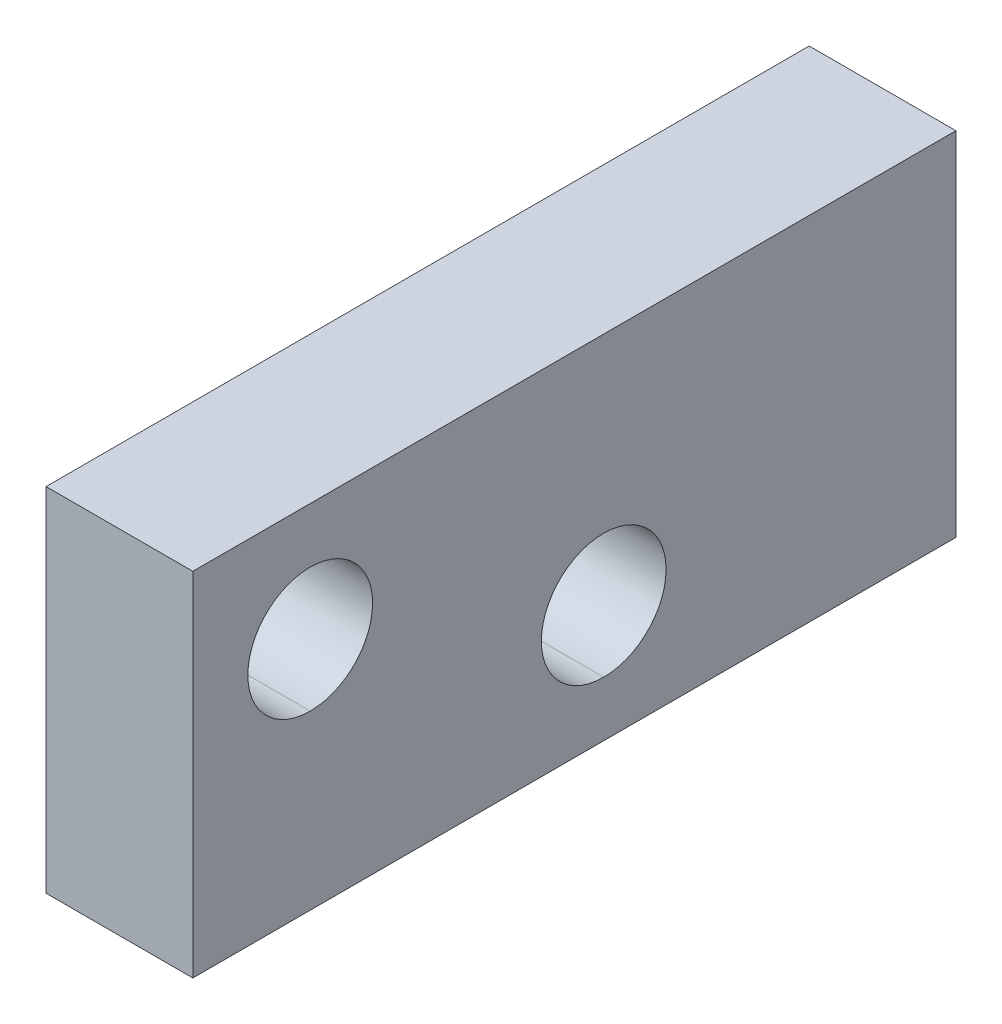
ISO-10303-21;
HEADER;
FILE_DESCRIPTION(('STEP AP214'),'2;1');
FILE_NAME('part.step','',(''),(''),'','','');
FILE_SCHEMA(('AUTOMOTIVE_DESIGN { 1 0 10303 214 1 1 1 1 }'));
ENDSEC;
DATA;
#1=APPLICATION_CONTEXT('core data for automotive mechanical design processes');
#2=APPLICATION_PROTOCOL_DEFINITION('international standard','automotive_design',2000,#1);
#3=PRODUCT_CONTEXT('',#1,'mechanical');
#4=PRODUCT('Part','Part','',(#3));
#5=PRODUCT_RELATED_PRODUCT_CATEGORY('part','',(#4));
#6=PRODUCT_DEFINITION_FORMATION('','',#4);
#7=PRODUCT_DEFINITION_CONTEXT('part definition',#1,'design');
#8=PRODUCT_DEFINITION('design','',#6,#7);
#9=PRODUCT_DEFINITION_SHAPE('','',#8);
#10=(LENGTH_UNIT() NAMED_UNIT(*) SI_UNIT(.MILLI.,.METRE.));
#11=(NAMED_UNIT(*) PLANE_ANGLE_UNIT() SI_UNIT($,.RADIAN.));
#12=(NAMED_UNIT(*) SI_UNIT($,.STERADIAN.) SOLID_ANGLE_UNIT());
#13=UNCERTAINTY_MEASURE_WITH_UNIT(LENGTH_MEASURE(1.E-05),#10,'distance_accuracy_value','');
#14=(GEOMETRIC_REPRESENTATION_CONTEXT(3) GLOBAL_UNCERTAINTY_ASSIGNED_CONTEXT((#13)) GLOBAL_UNIT_ASSIGNED_CONTEXT((#10,
#11,#12)) REPRESENTATION_CONTEXT('',''));
#15=CARTESIAN_POINT('',(0.,0.,0.));
#16=DIRECTION('',(0.,0.,1.));
#17=DIRECTION('',(1.,0.,0.));
#18=AXIS2_PLACEMENT_3D('',#15,#16,#17);
#19=CARTESIAN_POINT('',(7.9375,0.,0.));
#20=DIRECTION('',(-1.,0.,0.));
#21=DIRECTION('',(0.,0.,1.));
#22=AXIS2_PLACEMENT_3D('',#19,#20,#21);
#23=PLANE('',#22);
#24=DIRECTION('',(0.,1.,0.));
#25=VECTOR('',#24,1.);
#26=CARTESIAN_POINT('',(7.9375,0.,-41.275));
#27=LINE('',#26,#25);
#28=CARTESIAN_POINT('',(7.9375,-19.0499999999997,-41.275));
#29=VERTEX_POINT('',#28);
#30=CARTESIAN_POINT('',(7.9375,19.0499999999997,-41.275));
#31=VERTEX_POINT('',#30);
#32=EDGE_CURVE('E161',#29,#31,#27,.T.);
#33=ORIENTED_EDGE('',*,*,#32,.T.);
#34=DIRECTION('',(0.,0.,-1.));
#35=VECTOR('',#34,1.);
#36=CARTESIAN_POINT('',(7.9375,19.0499999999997,0.));
#37=LINE('',#36,#35);
#38=CARTESIAN_POINT('',(7.9375,19.0499999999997,41.275));
#39=VERTEX_POINT('',#38);
#40=EDGE_CURVE('E107',#31,#39,#37,.F.);
#41=ORIENTED_EDGE('',*,*,#40,.T.);
#42=DIRECTION('',(0.,1.,0.));
#43=VECTOR('',#42,1.);
#44=CARTESIAN_POINT('',(7.9375,0.,41.275));
#45=LINE('',#44,#43);
#46=CARTESIAN_POINT('',(7.9375,-19.0499999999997,41.275));
#47=VERTEX_POINT('',#46);
#48=EDGE_CURVE('E181',#47,#39,#45,.T.);
#49=ORIENTED_EDGE('',*,*,#48,.F.);
#50=DIRECTION('',(0.,0.,1.));
#51=VECTOR('',#50,1.);
#52=CARTESIAN_POINT('',(7.9375,-19.0499999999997,0.));
#53=LINE('',#52,#51);
#54=EDGE_CURVE('E163',#47,#29,#53,.F.);
#55=ORIENTED_EDGE('',*,*,#54,.T.);
#56=EDGE_LOOP('',(#33,#41,#49,#55));
#57=FACE_BOUND('',#56,.T.);
#58=CARTESIAN_POINT('',(7.9375,6.34999999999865,28.575));
#59=DIRECTION('',(-1.,0.,0.));
#60=DIRECTION('',(0.,0.,1.));
#61=AXIS2_PLACEMENT_3D('',#58,#59,#60);
#62=CIRCLE('',#61,6.746875);
#63=CARTESIAN_POINT('',(7.9375,-0.396875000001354,28.575));
#64=VERTEX_POINT('',#63);
#65=CARTESIAN_POINT('',(7.9375,13.0968749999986,28.575));
#66=VERTEX_POINT('',#65);
#67=EDGE_CURVE('E113',#64,#66,#62,.T.);
#68=ORIENTED_EDGE('',*,*,#67,.T.);
#69=CARTESIAN_POINT('',(7.9375,6.34999999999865,28.575));
#70=DIRECTION('',(-1.,0.,0.));
#71=DIRECTION('',(0.,0.,1.));
#72=AXIS2_PLACEMENT_3D('',#69,#70,#71);
#73=CIRCLE('',#72,6.746875);
#74=EDGE_CURVE('E108',#66,#64,#73,.T.);
#75=ORIENTED_EDGE('',*,*,#74,.T.);
#76=EDGE_LOOP('',(#68,#75));
#77=FACE_BOUND('',#76,.T.);
#78=CARTESIAN_POINT('',(7.9375,-6.34999999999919,-3.175));
#79=DIRECTION('',(-1.,0.,0.));
#80=DIRECTION('',(0.,0.,1.));
#81=AXIS2_PLACEMENT_3D('',#78,#79,#80);
#82=CIRCLE('',#81,6.746875);
#83=CARTESIAN_POINT('',(7.9375,-13.0968749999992,-3.175));
#84=VERTEX_POINT('',#83);
#85=CARTESIAN_POINT('',(7.9375,0.396875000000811,-3.175));
#86=VERTEX_POINT('',#85);
#87=EDGE_CURVE('E19',#84,#86,#82,.T.);
#88=ORIENTED_EDGE('',*,*,#87,.T.);
#89=CARTESIAN_POINT('',(7.9375,-6.34999999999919,-3.175));
#90=DIRECTION('',(-1.,0.,0.));
#91=DIRECTION('',(0.,0.,1.));
#92=AXIS2_PLACEMENT_3D('',#89,#90,#91);
#93=CIRCLE('',#92,6.746875);
#94=EDGE_CURVE('E83',#86,#84,#93,.T.);
#95=ORIENTED_EDGE('',*,*,#94,.T.);
#96=EDGE_LOOP('',(#88,#95));
#97=FACE_BOUND('',#96,.T.);
#98=ADVANCED_FACE('F16',(#57,#77,#97),#23,.F.);
#99=CARTESIAN_POINT('',(4.7625,-6.34999999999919,-3.175));
#100=DIRECTION('',(-1.,0.,0.));
#101=DIRECTION('',(0.,0.,1.));
#102=AXIS2_PLACEMENT_3D('',#99,#100,#101);
#103=CYLINDRICAL_SURFACE('',#102,6.746875);
#104=CARTESIAN_POINT('',(-7.9375,-6.34999999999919,-3.175));
#105=DIRECTION('',(-1.,0.,0.));
#106=DIRECTION('',(0.,0.,1.));
#107=AXIS2_PLACEMENT_3D('',#104,#105,#106);
#108=CIRCLE('',#107,6.746875);
#109=CARTESIAN_POINT('',(-7.9375,-13.0968749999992,-3.175));
#110=VERTEX_POINT('',#109);
#111=CARTESIAN_POINT('',(-7.9375,0.396875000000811,-3.175));
#112=VERTEX_POINT('',#111);
#113=EDGE_CURVE('E92',#110,#112,#108,.T.);
#114=ORIENTED_EDGE('',*,*,#113,.T.);
#115=DIRECTION('',(-1.,0.,0.));
#116=VECTOR('',#115,1.);
#117=CARTESIAN_POINT('',(4.7625,0.396875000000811,-3.175));
#118=LINE('',#117,#116);
#119=EDGE_CURVE('E84',#112,#86,#118,.F.);
#120=ORIENTED_EDGE('',*,*,#119,.T.);
#121=ORIENTED_EDGE('',*,*,#87,.F.);
#122=DIRECTION('',(-1.,0.,0.));
#123=VECTOR('',#122,1.);
#124=CARTESIAN_POINT('',(4.7625,-13.0968749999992,-3.175));
#125=LINE('',#124,#123);
#126=EDGE_CURVE('E89',#84,#110,#125,.T.);
#127=ORIENTED_EDGE('',*,*,#126,.T.);
#128=EDGE_LOOP('',(#114,#120,#121,#127));
#129=FACE_BOUND('',#128,.T.);
#130=ADVANCED_FACE('F91',(#129),#103,.F.);
#131=CARTESIAN_POINT('',(4.7625,-6.34999999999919,-3.175));
#132=DIRECTION('',(-1.,0.,0.));
#133=DIRECTION('',(0.,0.,1.));
#134=AXIS2_PLACEMENT_3D('',#131,#132,#133);
#135=CYLINDRICAL_SURFACE('',#134,6.746875);
#136=ORIENTED_EDGE('',*,*,#94,.F.);
#137=ORIENTED_EDGE('',*,*,#119,.F.);
#138=CARTESIAN_POINT('',(-7.9375,-6.34999999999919,-3.175));
#139=DIRECTION('',(-1.,0.,0.));
#140=DIRECTION('',(0.,0.,1.));
#141=AXIS2_PLACEMENT_3D('',#138,#139,#140);
#142=CIRCLE('',#141,6.746875);
#143=EDGE_CURVE('E104',#112,#110,#142,.T.);
#144=ORIENTED_EDGE('',*,*,#143,.T.);
#145=ORIENTED_EDGE('',*,*,#126,.F.);
#146=EDGE_LOOP('',(#136,#137,#144,#145));
#147=FACE_BOUND('',#146,.T.);
#148=ADVANCED_FACE('F86',(#147),#135,.F.);
#149=CARTESIAN_POINT('',(4.7625,6.34999999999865,28.575));
#150=DIRECTION('',(-1.,0.,0.));
#151=DIRECTION('',(0.,0.,1.));
#152=AXIS2_PLACEMENT_3D('',#149,#150,#151);
#153=CYLINDRICAL_SURFACE('',#152,6.746875);
#154=CARTESIAN_POINT('',(-7.9375,6.34999999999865,28.575));
#155=DIRECTION('',(-1.,0.,0.));
#156=DIRECTION('',(0.,0.,1.));
#157=AXIS2_PLACEMENT_3D('',#154,#155,#156);
#158=CIRCLE('',#157,6.746875);
#159=CARTESIAN_POINT('',(-7.9375,-0.396875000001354,28.575));
#160=VERTEX_POINT('',#159);
#161=CARTESIAN_POINT('',(-7.9375,13.0968749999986,28.575));
#162=VERTEX_POINT('',#161);
#163=EDGE_CURVE('E101',#160,#162,#158,.T.);
#164=ORIENTED_EDGE('',*,*,#163,.T.);
#165=DIRECTION('',(-1.,0.,0.));
#166=VECTOR('',#165,1.);
#167=CARTESIAN_POINT('',(4.7625,13.0968749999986,28.575));
#168=LINE('',#167,#166);
#169=EDGE_CURVE('E112',#162,#66,#168,.F.);
#170=ORIENTED_EDGE('',*,*,#169,.T.);
#171=ORIENTED_EDGE('',*,*,#67,.F.);
#172=DIRECTION('',(-1.,0.,0.));
#173=VECTOR('',#172,1.);
#174=CARTESIAN_POINT('',(4.7625,-0.396875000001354,28.575));
#175=LINE('',#174,#173);
#176=EDGE_CURVE('E111',#64,#160,#175,.T.);
#177=ORIENTED_EDGE('',*,*,#176,.T.);
#178=EDGE_LOOP('',(#164,#170,#171,#177));
#179=FACE_BOUND('',#178,.T.);
#180=ADVANCED_FACE('F146',(#179),#153,.F.);
#181=CARTESIAN_POINT('',(4.7625,6.34999999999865,28.575));
#182=DIRECTION('',(-1.,0.,0.));
#183=DIRECTION('',(0.,0.,1.));
#184=AXIS2_PLACEMENT_3D('',#181,#182,#183);
#185=CYLINDRICAL_SURFACE('',#184,6.746875);
#186=ORIENTED_EDGE('',*,*,#74,.F.);
#187=ORIENTED_EDGE('',*,*,#169,.F.);
#188=CARTESIAN_POINT('',(-7.9375,6.34999999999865,28.575));
#189=DIRECTION('',(-1.,0.,0.));
#190=DIRECTION('',(0.,0.,1.));
#191=AXIS2_PLACEMENT_3D('',#188,#189,#190);
#192=CIRCLE('',#191,6.746875);
#193=EDGE_CURVE('E97',#162,#160,#192,.T.);
#194=ORIENTED_EDGE('',*,*,#193,.T.);
#195=ORIENTED_EDGE('',*,*,#176,.F.);
#196=EDGE_LOOP('',(#186,#187,#194,#195));
#197=FACE_BOUND('',#196,.T.);
#198=ADVANCED_FACE('F142',(#197),#185,.F.);
#199=CARTESIAN_POINT('',(0.,0.,41.275));
#200=DIRECTION('',(0.,0.,1.));
#201=DIRECTION('',(1.,0.,0.));
#202=AXIS2_PLACEMENT_3D('',#199,#200,#201);
#203=PLANE('',#202);
#204=DIRECTION('',(0.,1.,0.));
#205=VECTOR('',#204,1.);
#206=CARTESIAN_POINT('',(-7.9375,0.,41.275));
#207=LINE('',#206,#205);
#208=CARTESIAN_POINT('',(-7.9375,19.0499999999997,41.275));
#209=VERTEX_POINT('',#208);
#210=CARTESIAN_POINT('',(-7.9375,-19.0499999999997,41.275));
#211=VERTEX_POINT('',#210);
#212=EDGE_CURVE('E100',#209,#211,#207,.F.);
#213=ORIENTED_EDGE('',*,*,#212,.T.);
#214=DIRECTION('',(1.,0.,0.));
#215=VECTOR('',#214,1.);
#216=CARTESIAN_POINT('',(0.,-19.0499999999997,41.275));
#217=LINE('',#216,#215);
#218=EDGE_CURVE('E178',#211,#47,#217,.T.);
#219=ORIENTED_EDGE('',*,*,#218,.T.);
#220=ORIENTED_EDGE('',*,*,#48,.T.);
#221=DIRECTION('',(1.,0.,0.));
#222=VECTOR('',#221,1.);
#223=CARTESIAN_POINT('',(0.,19.0499999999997,41.275));
#224=LINE('',#223,#222);
#225=EDGE_CURVE('E165',#39,#209,#224,.F.);
#226=ORIENTED_EDGE('',*,*,#225,.T.);
#227=EDGE_LOOP('',(#213,#219,#220,#226));
#228=FACE_BOUND('',#227,.T.);
#229=ADVANCED_FACE('F138',(#228),#203,.T.);
#230=CARTESIAN_POINT('',(0.,-19.0499999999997,0.));
#231=DIRECTION('',(0.,1.,0.));
#232=DIRECTION('',(0.,0.,1.));
#233=AXIS2_PLACEMENT_3D('',#230,#231,#232);
#234=PLANE('',#233);
#235=DIRECTION('',(1.,0.,0.));
#236=VECTOR('',#235,1.);
#237=CARTESIAN_POINT('',(0.,-19.0499999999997,-41.275));
#238=LINE('',#237,#236);
#239=CARTESIAN_POINT('',(-7.9375,-19.0499999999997,-41.275));
#240=VERTEX_POINT('',#239);
#241=EDGE_CURVE('E166',#240,#29,#238,.T.);
#242=ORIENTED_EDGE('',*,*,#241,.T.);
#243=ORIENTED_EDGE('',*,*,#54,.F.);
#244=ORIENTED_EDGE('',*,*,#218,.F.);
#245=DIRECTION('',(0.,0.,-1.));
#246=VECTOR('',#245,1.);
#247=CARTESIAN_POINT('',(-7.9375,-19.0499999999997,0.));
#248=LINE('',#247,#246);
#249=EDGE_CURVE('E189',#211,#240,#248,.T.);
#250=ORIENTED_EDGE('',*,*,#249,.T.);
#251=EDGE_LOOP('',(#242,#243,#244,#250));
#252=FACE_BOUND('',#251,.T.);
#253=ADVANCED_FACE('F134',(#252),#234,.F.);
#254=CARTESIAN_POINT('',(0.,0.,-41.275));
#255=DIRECTION('',(0.,0.,1.));
#256=DIRECTION('',(1.,0.,0.));
#257=AXIS2_PLACEMENT_3D('',#254,#255,#256);
#258=PLANE('',#257);
#259=ORIENTED_EDGE('',*,*,#241,.F.);
#260=DIRECTION('',(0.,1.,0.));
#261=VECTOR('',#260,1.);
#262=CARTESIAN_POINT('',(-7.9375,0.,-41.275));
#263=LINE('',#262,#261);
#264=CARTESIAN_POINT('',(-7.9375,19.0499999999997,-41.275));
#265=VERTEX_POINT('',#264);
#266=EDGE_CURVE('E25',#240,#265,#263,.T.);
#267=ORIENTED_EDGE('',*,*,#266,.T.);
#268=DIRECTION('',(1.,0.,0.));
#269=VECTOR('',#268,1.);
#270=CARTESIAN_POINT('',(0.,19.0499999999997,-41.275));
#271=LINE('',#270,#269);
#272=EDGE_CURVE('E33',#265,#31,#271,.T.);
#273=ORIENTED_EDGE('',*,*,#272,.T.);
#274=ORIENTED_EDGE('',*,*,#32,.F.);
#275=EDGE_LOOP('',(#259,#267,#273,#274));
#276=FACE_BOUND('',#275,.T.);
#277=ADVANCED_FACE('F127',(#276),#258,.F.);
#278=CARTESIAN_POINT('',(0.,19.0499999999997,0.));
#279=DIRECTION('',(0.,-1.,0.));
#280=DIRECTION('',(0.,0.,-1.));
#281=AXIS2_PLACEMENT_3D('',#278,#279,#280);
#282=PLANE('',#281);
#283=ORIENTED_EDGE('',*,*,#272,.F.);
#284=DIRECTION('',(0.,0.,-1.));
#285=VECTOR('',#284,1.);
#286=CARTESIAN_POINT('',(-7.9375,19.0499999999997,0.));
#287=LINE('',#286,#285);
#288=EDGE_CURVE('E11',#265,#209,#287,.F.);
#289=ORIENTED_EDGE('',*,*,#288,.T.);
#290=ORIENTED_EDGE('',*,*,#225,.F.);
#291=ORIENTED_EDGE('',*,*,#40,.F.);
#292=EDGE_LOOP('',(#283,#289,#290,#291));
#293=FACE_BOUND('',#292,.T.);
#294=ADVANCED_FACE('F120',(#293),#282,.F.);
#295=CARTESIAN_POINT('',(-7.9375,0.,0.));
#296=DIRECTION('',(1.,0.,0.));
#297=DIRECTION('',(0.,0.,-1.));
#298=AXIS2_PLACEMENT_3D('',#295,#296,#297);
#299=PLANE('',#298);
#300=ORIENTED_EDGE('',*,*,#266,.F.);
#301=ORIENTED_EDGE('',*,*,#249,.F.);
#302=ORIENTED_EDGE('',*,*,#212,.F.);
#303=ORIENTED_EDGE('',*,*,#288,.F.);
#304=EDGE_LOOP('',(#300,#301,#302,#303));
#305=FACE_BOUND('',#304,.T.);
#306=ORIENTED_EDGE('',*,*,#163,.F.);
#307=ORIENTED_EDGE('',*,*,#193,.F.);
#308=EDGE_LOOP('',(#306,#307));
#309=FACE_BOUND('',#308,.T.);
#310=ORIENTED_EDGE('',*,*,#113,.F.);
#311=ORIENTED_EDGE('',*,*,#143,.F.);
#312=EDGE_LOOP('',(#310,#311));
#313=FACE_BOUND('',#312,.T.);
#314=ADVANCED_FACE('F118',(#305,#309,#313),#299,.F.);
#315=CLOSED_SHELL('',(#98,#130,#148,#180,#198,#229,#253,#277,#294,#314));
#316=MANIFOLD_SOLID_BREP('B1',#315);
#317=ADVANCED_BREP_SHAPE_REPRESENTATION('',(#18,#316),#14);
#318=SHAPE_DEFINITION_REPRESENTATION(#9,#317);
ENDSEC;
END-ISO-10303-21;
